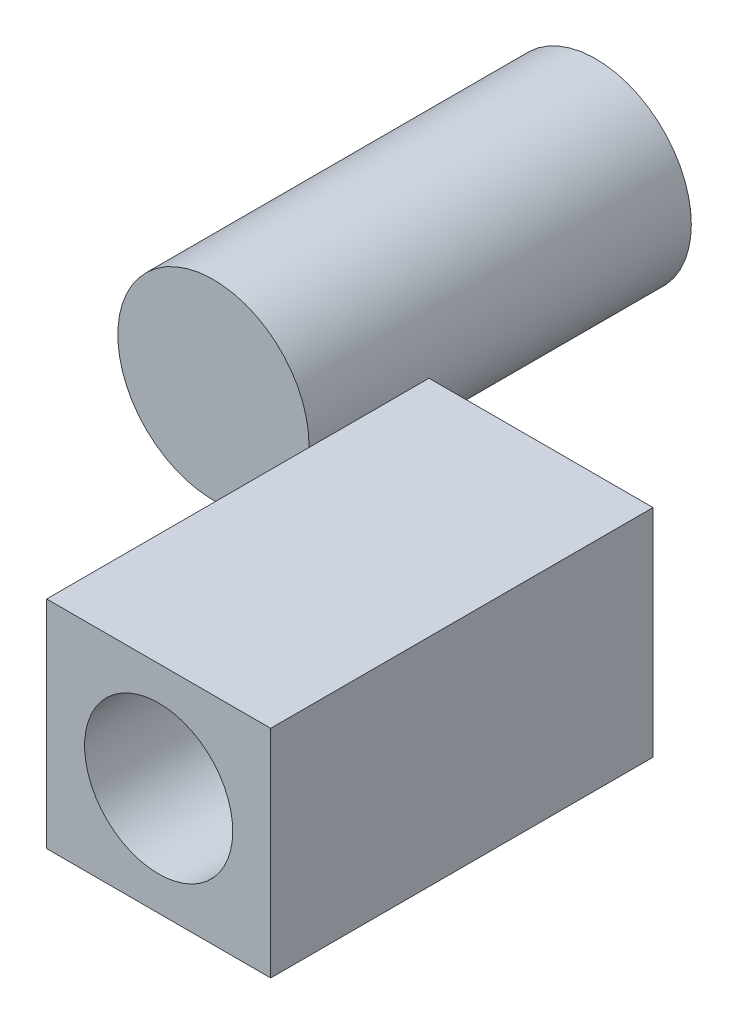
ISO-10303-21;
HEADER;
FILE_DESCRIPTION(('STEP AP214'),'2;1');
FILE_NAME('part.step','',(''),(''),'','','');
FILE_SCHEMA(('AUTOMOTIVE_DESIGN { 1 0 10303 214 1 1 1 1 }'));
ENDSEC;
DATA;
#1=APPLICATION_CONTEXT('core data for automotive mechanical design processes');
#2=APPLICATION_PROTOCOL_DEFINITION('international standard','automotive_design',2000,#1);
#3=PRODUCT_CONTEXT('',#1,'mechanical');
#4=PRODUCT('Part','Part','',(#3));
#5=PRODUCT_RELATED_PRODUCT_CATEGORY('part','',(#4));
#6=PRODUCT_DEFINITION_FORMATION('','',#4);
#7=PRODUCT_DEFINITION_CONTEXT('part definition',#1,'design');
#8=PRODUCT_DEFINITION('design','',#6,#7);
#9=PRODUCT_DEFINITION_SHAPE('','',#8);
#10=(LENGTH_UNIT() NAMED_UNIT(*) SI_UNIT(.MILLI.,.METRE.));
#11=(NAMED_UNIT(*) PLANE_ANGLE_UNIT() SI_UNIT($,.RADIAN.));
#12=(NAMED_UNIT(*) SI_UNIT($,.STERADIAN.) SOLID_ANGLE_UNIT());
#13=UNCERTAINTY_MEASURE_WITH_UNIT(LENGTH_MEASURE(1.E-05),#10,'distance_accuracy_value','');
#14=(GEOMETRIC_REPRESENTATION_CONTEXT(3) GLOBAL_UNCERTAINTY_ASSIGNED_CONTEXT((#13)) GLOBAL_UNIT_ASSIGNED_CONTEXT((#10,
#11,#12)) REPRESENTATION_CONTEXT('',''));
#15=CARTESIAN_POINT('',(0.,0.,0.));
#16=DIRECTION('',(0.,0.,1.));
#17=DIRECTION('',(1.,0.,0.));
#18=AXIS2_PLACEMENT_3D('',#15,#16,#17);
#19=CARTESIAN_POINT('',(56.3871440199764,30.8408327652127,200.));
#20=DIRECTION('',(0.,0.,-1.));
#21=DIRECTION('',(-1.,0.,0.));
#22=AXIS2_PLACEMENT_3D('',#19,#20,#21);
#23=PLANE('',#22);
#24=DIRECTION('',(0.,-1.,0.));
#25=VECTOR('',#24,1.);
#26=CARTESIAN_POINT('',(56.3871440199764,-25.7205197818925,200.));
#27=LINE('',#26,#25);
#28=CARTESIAN_POINT('',(56.3871440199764,30.8408327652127,200.));
#29=VERTEX_POINT('',#28);
#30=CARTESIAN_POINT('',(56.3871440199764,-25.7205197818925,200.));
#31=VERTEX_POINT('',#30);
#32=EDGE_CURVE('E93',#29,#31,#27,.T.);
#33=ORIENTED_EDGE('',*,*,#32,.T.);
#34=DIRECTION('',(1.,0.,0.));
#35=VECTOR('',#34,1.);
#36=CARTESIAN_POINT('',(56.3871440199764,-25.7205197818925,200.));
#37=LINE('',#36,#35);
#38=CARTESIAN_POINT('',(114.978904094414,-25.7205197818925,200.));
#39=VERTEX_POINT('',#38);
#40=EDGE_CURVE('E88',#31,#39,#37,.T.);
#41=ORIENTED_EDGE('',*,*,#40,.T.);
#42=DIRECTION('',(0.,1.,0.));
#43=VECTOR('',#42,1.);
#44=CARTESIAN_POINT('',(114.978904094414,-25.7205197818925,200.));
#45=LINE('',#44,#43);
#46=CARTESIAN_POINT('',(114.978904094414,30.8408327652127,200.));
#47=VERTEX_POINT('',#46);
#48=EDGE_CURVE('E91',#39,#47,#45,.T.);
#49=ORIENTED_EDGE('',*,*,#48,.T.);
#50=DIRECTION('',(-1.,0.,0.));
#51=VECTOR('',#50,1.);
#52=CARTESIAN_POINT('',(56.3871440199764,30.8408327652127,200.));
#53=LINE('',#52,#51);
#54=EDGE_CURVE('E58',#47,#29,#53,.T.);
#55=ORIENTED_EDGE('',*,*,#54,.T.);
#56=EDGE_LOOP('',(#33,#41,#49,#55));
#57=FACE_BOUND('',#56,.T.);
#58=CARTESIAN_POINT('',(85.6830240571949,2.56015649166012,200.));
#59=DIRECTION('',(0.,0.,1.));
#60=DIRECTION('',(1.,0.,0.));
#61=AXIS2_PLACEMENT_3D('',#58,#59,#60);
#62=CIRCLE('',#61,19.3759106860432);
#63=CARTESIAN_POINT('',(105.058934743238,2.56015649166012,200.));
#64=VERTEX_POINT('',#63);
#65=EDGE_CURVE('E108',#64,#64,#62,.T.);
#66=ORIENTED_EDGE('',*,*,#65,.F.);
#67=EDGE_LOOP('',(#66));
#68=FACE_BOUND('',#67,.T.);
#69=ADVANCED_FACE('F41',(#57,#68),#23,.F.);
#70=CARTESIAN_POINT('',(56.3871440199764,30.8408327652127,100.));
#71=DIRECTION('',(0.,0.,-1.));
#72=DIRECTION('',(-1.,0.,0.));
#73=AXIS2_PLACEMENT_3D('',#70,#71,#72);
#74=PLANE('',#73);
#75=DIRECTION('',(0.,-1.,0.));
#76=VECTOR('',#75,1.);
#77=CARTESIAN_POINT('',(56.3871440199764,-25.7205197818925,100.));
#78=LINE('',#77,#76);
#79=CARTESIAN_POINT('',(56.3871440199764,30.8408327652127,100.));
#80=VERTEX_POINT('',#79);
#81=CARTESIAN_POINT('',(56.3871440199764,-25.7205197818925,100.));
#82=VERTEX_POINT('',#81);
#83=EDGE_CURVE('E105',#80,#82,#78,.T.);
#84=ORIENTED_EDGE('',*,*,#83,.F.);
#85=DIRECTION('',(-1.,0.,0.));
#86=VECTOR('',#85,1.);
#87=CARTESIAN_POINT('',(56.3871440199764,30.8408327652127,100.));
#88=LINE('',#87,#86);
#89=CARTESIAN_POINT('',(114.978904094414,30.8408327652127,100.));
#90=VERTEX_POINT('',#89);
#91=EDGE_CURVE('E81',#90,#80,#88,.T.);
#92=ORIENTED_EDGE('',*,*,#91,.F.);
#93=DIRECTION('',(0.,1.,0.));
#94=VECTOR('',#93,1.);
#95=CARTESIAN_POINT('',(114.978904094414,-25.7205197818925,100.));
#96=LINE('',#95,#94);
#97=CARTESIAN_POINT('',(114.978904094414,-25.7205197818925,100.));
#98=VERTEX_POINT('',#97);
#99=EDGE_CURVE('E75',#98,#90,#96,.T.);
#100=ORIENTED_EDGE('',*,*,#99,.F.);
#101=DIRECTION('',(1.,0.,0.));
#102=VECTOR('',#101,1.);
#103=CARTESIAN_POINT('',(56.3871440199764,-25.7205197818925,100.));
#104=LINE('',#103,#102);
#105=EDGE_CURVE('E97',#82,#98,#104,.T.);
#106=ORIENTED_EDGE('',*,*,#105,.F.);
#107=EDGE_LOOP('',(#84,#92,#100,#106));
#108=FACE_BOUND('',#107,.T.);
#109=CARTESIAN_POINT('',(85.6830240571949,2.56015649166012,100.));
#110=DIRECTION('',(0.,0.,1.));
#111=DIRECTION('',(1.,0.,0.));
#112=AXIS2_PLACEMENT_3D('',#109,#110,#111);
#113=CIRCLE('',#112,19.3759106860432);
#114=CARTESIAN_POINT('',(105.058934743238,2.56015649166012,100.));
#115=VERTEX_POINT('',#114);
#116=EDGE_CURVE('E120',#115,#115,#113,.T.);
#117=ORIENTED_EDGE('',*,*,#116,.T.);
#118=EDGE_LOOP('',(#117));
#119=FACE_BOUND('',#118,.T.);
#120=ADVANCED_FACE('F116',(#108,#119),#74,.T.);
#121=CARTESIAN_POINT('',(56.3871440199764,-25.7205197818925,200.));
#122=DIRECTION('',(1.,0.,0.));
#123=DIRECTION('',(0.,0.,-1.));
#124=AXIS2_PLACEMENT_3D('',#121,#122,#123);
#125=PLANE('',#124);
#126=ORIENTED_EDGE('',*,*,#83,.T.);
#127=DIRECTION('',(0.,0.,-1.));
#128=VECTOR('',#127,1.);
#129=CARTESIAN_POINT('',(56.3871440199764,-25.7205197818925,200.));
#130=LINE('',#129,#128);
#131=EDGE_CURVE('E12',#31,#82,#130,.T.);
#132=ORIENTED_EDGE('',*,*,#131,.F.);
#133=ORIENTED_EDGE('',*,*,#32,.F.);
#134=DIRECTION('',(0.,0.,-1.));
#135=VECTOR('',#134,1.);
#136=CARTESIAN_POINT('',(56.3871440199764,30.8408327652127,200.));
#137=LINE('',#136,#135);
#138=EDGE_CURVE('E101',#29,#80,#137,.T.);
#139=ORIENTED_EDGE('',*,*,#138,.T.);
#140=EDGE_LOOP('',(#126,#132,#133,#139));
#141=FACE_BOUND('',#140,.T.);
#142=ADVANCED_FACE('F43',(#141),#125,.F.);
#143=CARTESIAN_POINT('',(56.3871440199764,-25.7205197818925,200.));
#144=DIRECTION('',(0.,1.,0.));
#145=DIRECTION('',(0.,0.,1.));
#146=AXIS2_PLACEMENT_3D('',#143,#144,#145);
#147=PLANE('',#146);
#148=ORIENTED_EDGE('',*,*,#105,.T.);
#149=DIRECTION('',(0.,0.,-1.));
#150=VECTOR('',#149,1.);
#151=CARTESIAN_POINT('',(114.978904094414,-25.7205197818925,200.));
#152=LINE('',#151,#150);
#153=EDGE_CURVE('E50',#39,#98,#152,.T.);
#154=ORIENTED_EDGE('',*,*,#153,.F.);
#155=ORIENTED_EDGE('',*,*,#40,.F.);
#156=ORIENTED_EDGE('',*,*,#131,.T.);
#157=EDGE_LOOP('',(#148,#154,#155,#156));
#158=FACE_BOUND('',#157,.T.);
#159=ADVANCED_FACE('F96',(#158),#147,.F.);
#160=CARTESIAN_POINT('',(114.978904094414,-25.7205197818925,200.));
#161=DIRECTION('',(-1.,0.,0.));
#162=DIRECTION('',(0.,0.,1.));
#163=AXIS2_PLACEMENT_3D('',#160,#161,#162);
#164=PLANE('',#163);
#165=ORIENTED_EDGE('',*,*,#99,.T.);
#166=DIRECTION('',(0.,0.,-1.));
#167=VECTOR('',#166,1.);
#168=CARTESIAN_POINT('',(114.978904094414,30.8408327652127,200.));
#169=LINE('',#168,#167);
#170=EDGE_CURVE('E98',#47,#90,#169,.T.);
#171=ORIENTED_EDGE('',*,*,#170,.F.);
#172=ORIENTED_EDGE('',*,*,#48,.F.);
#173=ORIENTED_EDGE('',*,*,#153,.T.);
#174=EDGE_LOOP('',(#165,#171,#172,#173));
#175=FACE_BOUND('',#174,.T.);
#176=ADVANCED_FACE('F99',(#175),#164,.F.);
#177=CARTESIAN_POINT('',(56.3871440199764,30.8408327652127,200.));
#178=DIRECTION('',(0.,-1.,0.));
#179=DIRECTION('',(0.,0.,-1.));
#180=AXIS2_PLACEMENT_3D('',#177,#178,#179);
#181=PLANE('',#180);
#182=ORIENTED_EDGE('',*,*,#91,.T.);
#183=ORIENTED_EDGE('',*,*,#138,.F.);
#184=ORIENTED_EDGE('',*,*,#54,.F.);
#185=ORIENTED_EDGE('',*,*,#170,.T.);
#186=EDGE_LOOP('',(#182,#183,#184,#185));
#187=FACE_BOUND('',#186,.T.);
#188=ADVANCED_FACE('F113',(#187),#181,.F.);
#189=CARTESIAN_POINT('',(85.6830240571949,2.56015649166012,200.));
#190=DIRECTION('',(0.,0.,-1.));
#191=DIRECTION('',(-1.,0.,0.));
#192=AXIS2_PLACEMENT_3D('',#189,#190,#191);
#193=CYLINDRICAL_SURFACE('',#192,19.3759106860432);
#194=ORIENTED_EDGE('',*,*,#65,.T.);
#195=EDGE_LOOP('',(#194));
#196=FACE_BOUND('',#195,.T.);
#197=ORIENTED_EDGE('',*,*,#116,.F.);
#198=EDGE_LOOP('',(#197));
#199=FACE_BOUND('',#198,.T.);
#200=ADVANCED_FACE('F126',(#196,#199),#193,.F.);
#201=CLOSED_SHELL('',(#69,#120,#142,#159,#176,#188,#200));
#202=MANIFOLD_SOLID_BREP('B2',#201);
#203=CARTESIAN_POINT('',(0.,0.,100.));
#204=DIRECTION('',(0.,0.,-1.));
#205=DIRECTION('',(-1.,0.,0.));
#206=AXIS2_PLACEMENT_3D('',#203,#204,#205);
#207=CYLINDRICAL_SURFACE('',#206,25.);
#208=CARTESIAN_POINT('',(0.,0.,100.));
#209=DIRECTION('',(0.,0.,1.));
#210=DIRECTION('',(1.,0.,0.));
#211=AXIS2_PLACEMENT_3D('',#208,#209,#210);
#212=CIRCLE('',#211,25.);
#213=CARTESIAN_POINT('',(25.,0.,100.));
#214=VERTEX_POINT('',#213);
#215=EDGE_CURVE('E40',#214,#214,#212,.T.);
#216=ORIENTED_EDGE('',*,*,#215,.F.);
#217=EDGE_LOOP('',(#216));
#218=FACE_BOUND('',#217,.T.);
#219=CARTESIAN_POINT('',(0.,0.,0.));
#220=DIRECTION('',(0.,0.,1.));
#221=DIRECTION('',(1.,0.,0.));
#222=AXIS2_PLACEMENT_3D('',#219,#220,#221);
#223=CIRCLE('',#222,25.);
#224=CARTESIAN_POINT('',(25.,0.,0.));
#225=VERTEX_POINT('',#224);
#226=EDGE_CURVE('E189',#225,#225,#223,.T.);
#227=ORIENTED_EDGE('',*,*,#226,.T.);
#228=EDGE_LOOP('',(#227));
#229=FACE_BOUND('',#228,.T.);
#230=ADVANCED_FACE('F186',(#218,#229),#207,.T.);
#231=CARTESIAN_POINT('',(0.,0.,100.));
#232=DIRECTION('',(0.,0.,1.));
#233=DIRECTION('',(1.,0.,0.));
#234=AXIS2_PLACEMENT_3D('',#231,#232,#233);
#235=PLANE('',#234);
#236=ORIENTED_EDGE('',*,*,#215,.T.);
#237=EDGE_LOOP('',(#236));
#238=FACE_BOUND('',#237,.T.);
#239=ADVANCED_FACE('F201',(#238),#235,.T.);
#240=CARTESIAN_POINT('',(0.,0.,0.));
#241=DIRECTION('',(0.,0.,1.));
#242=DIRECTION('',(1.,0.,0.));
#243=AXIS2_PLACEMENT_3D('',#240,#241,#242);
#244=PLANE('',#243);
#245=ORIENTED_EDGE('',*,*,#226,.F.);
#246=EDGE_LOOP('',(#245));
#247=FACE_BOUND('',#246,.T.);
#248=ADVANCED_FACE('F199',(#247),#244,.F.);
#249=CLOSED_SHELL('',(#230,#239,#248));
#250=MANIFOLD_SOLID_BREP('B6',#249);
#251=ADVANCED_BREP_SHAPE_REPRESENTATION('',(#18,#202,#250),#14);
#252=SHAPE_DEFINITION_REPRESENTATION(#9,#251);
ENDSEC;
END-ISO-10303-21;
